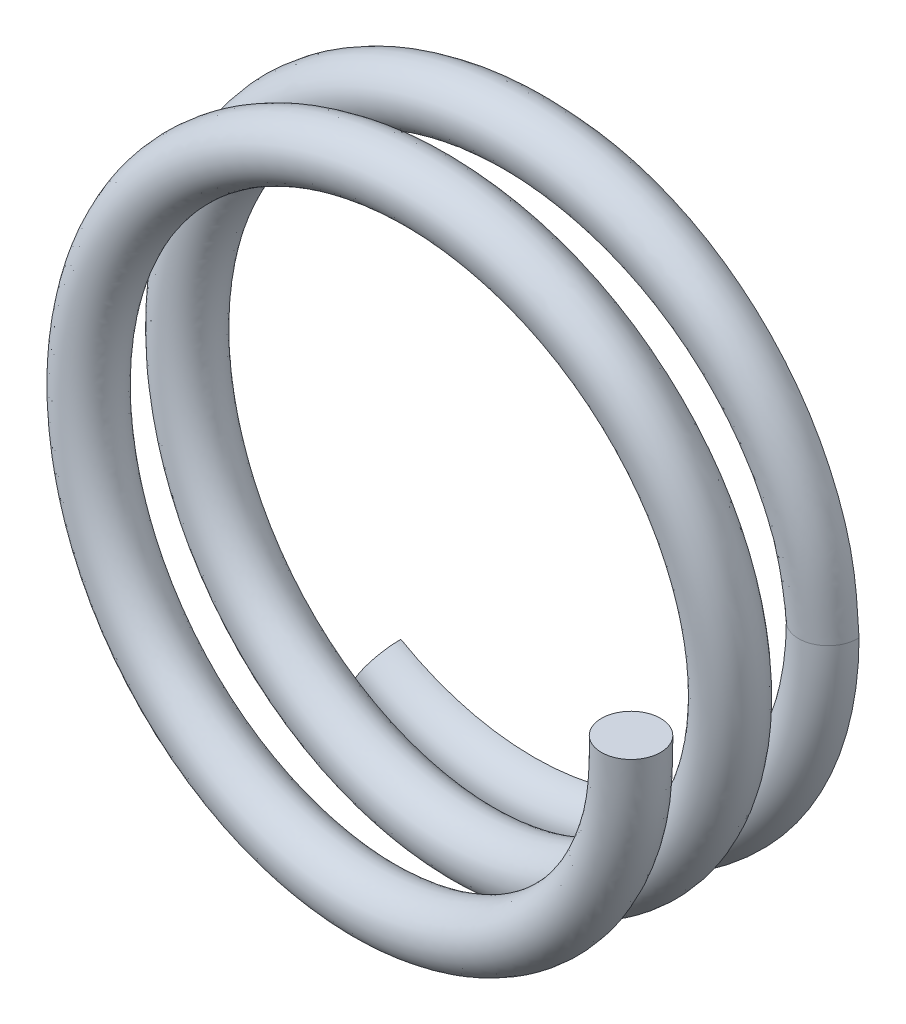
ISO-10303-21;
HEADER;
FILE_DESCRIPTION(('STEP AP214'),'2;1');
FILE_NAME('part.step','',(''),(''),'','','');
FILE_SCHEMA(('AUTOMOTIVE_DESIGN { 1 0 10303 214 1 1 1 1 }'));
ENDSEC;
DATA;
#1=APPLICATION_CONTEXT('core data for automotive mechanical design processes');
#2=APPLICATION_PROTOCOL_DEFINITION('international standard','automotive_design',2000,#1);
#3=PRODUCT_CONTEXT('',#1,'mechanical');
#4=PRODUCT('Part','Part','',(#3));
#5=PRODUCT_RELATED_PRODUCT_CATEGORY('part','',(#4));
#6=PRODUCT_DEFINITION_FORMATION('','',#4);
#7=PRODUCT_DEFINITION_CONTEXT('part definition',#1,'design');
#8=PRODUCT_DEFINITION('design','',#6,#7);
#9=PRODUCT_DEFINITION_SHAPE('','',#8);
#10=(LENGTH_UNIT() NAMED_UNIT(*) SI_UNIT(.MILLI.,.METRE.));
#11=(NAMED_UNIT(*) PLANE_ANGLE_UNIT() SI_UNIT($,.RADIAN.));
#12=(NAMED_UNIT(*) SI_UNIT($,.STERADIAN.) SOLID_ANGLE_UNIT());
#13=UNCERTAINTY_MEASURE_WITH_UNIT(LENGTH_MEASURE(1.E-05),#10,'distance_accuracy_value','');
#14=(GEOMETRIC_REPRESENTATION_CONTEXT(3) GLOBAL_UNCERTAINTY_ASSIGNED_CONTEXT((#13)) GLOBAL_UNIT_ASSIGNED_CONTEXT((#10,
#11,#12)) REPRESENTATION_CONTEXT('',''));
#15=CARTESIAN_POINT('',(0.,0.,0.));
#16=DIRECTION('',(0.,0.,1.));
#17=DIRECTION('',(1.,0.,0.));
#18=AXIS2_PLACEMENT_3D('',#15,#16,#17);
#19=CARTESIAN_POINT('',(15.,0.,1.5));
#20=CARTESIAN_POINT('',(14.9434686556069,0.980039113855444,1.55199637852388));
#21=CARTESIAN_POINT('',(14.8302225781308,2.94329660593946,1.65615781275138));
#22=CARTESIAN_POINT('',(13.9418455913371,5.77650274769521,1.81245356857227));
#23=CARTESIAN_POINT('',(12.5535226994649,8.38759891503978,1.96879275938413));
#24=CARTESIAN_POINT('',(10.4671696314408,10.9271623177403,2.14223062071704));
#25=CARTESIAN_POINT('',(7.58613571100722,13.1398555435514,2.33334011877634));
#26=CARTESIAN_POINT('',(3.92662071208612,14.6543917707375,2.54166504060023));
#27=CARTESIAN_POINT('',(4.11401899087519E-05,15.1715918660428,2.75000784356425));
#28=CARTESIAN_POINT('',(-3.92693257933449,14.6556022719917,2.95833111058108));
#29=CARTESIAN_POINT('',(-7.58586251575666,13.1389788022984,3.1666585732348));
#30=CARTESIAN_POINT('',(-10.7277085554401,10.7277374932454,3.37500627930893));
#31=CARTESIAN_POINT('',(-13.1395863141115,7.58619905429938,3.58333901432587));
#32=CARTESIAN_POINT('',(-14.6551693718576,3.92680798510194,3.79165669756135));
#33=CARTESIAN_POINT('',(-15.1712462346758,-3.12971002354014E-05,3.99999979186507));
#34=CARTESIAN_POINT('',(-14.6548300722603,-3.92669076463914,4.20834340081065));
#35=CARTESIAN_POINT('',(-13.1398206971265,-7.58627068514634,4.41666146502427));
#36=CARTESIAN_POINT('',(-10.7278130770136,-10.7278977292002,4.62499295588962));
#37=CARTESIAN_POINT('',(-7.58571450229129,-13.1387744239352,4.83334182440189));
#38=CARTESIAN_POINT('',(-3.92696085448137,-14.6554610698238,5.04166963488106));
#39=CARTESIAN_POINT('',(4.36291658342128E-05,-15.1719571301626,5.24998976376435));
#40=CARTESIAN_POINT('',(3.92661725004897,-14.6542791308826,5.45833563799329));
#41=CARTESIAN_POINT('',(7.5859316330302,-13.1393329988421,5.66667583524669));
#42=CARTESIAN_POINT('',(10.7285480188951,-10.7285399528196,5.87499262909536));
#43=CARTESIAN_POINT('',(13.1388208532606,-7.58563797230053,6.08332834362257));
#44=CARTESIAN_POINT('',(14.6545092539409,-3.92671133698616,6.29167635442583));
#45=CARTESIAN_POINT('',(15.1725636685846,-3.08605043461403E-05,6.50000018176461));
#46=CARTESIAN_POINT('',(14.6547973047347,3.92679649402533,6.70832353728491));
#47=CARTESIAN_POINT('',(13.1386860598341,7.58562008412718,6.91667133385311));
#48=CARTESIAN_POINT('',(10.7283643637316,10.7282883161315,7.12500762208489));
#49=CARTESIAN_POINT('',(7.58613817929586,13.1396144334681,7.33332434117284));
#50=CARTESIAN_POINT('',(3.92657585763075,14.6543562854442,7.54166400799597));
#51=CARTESIAN_POINT('',(5.35997314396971E-05,15.1716155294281,7.75001022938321));
#52=CARTESIAN_POINT('',(-3.92693805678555,14.6556080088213,7.95833071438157));
#53=CARTESIAN_POINT('',(-7.58585858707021,13.1389737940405,8.16665797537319));
#54=CARTESIAN_POINT('',(-10.7277098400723,10.7277381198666,8.37500677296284));
#55=CARTESIAN_POINT('',(-13.1395867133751,7.58619950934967,8.5833388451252));
#56=CARTESIAN_POINT('',(-14.6551692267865,3.92680794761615,8.79165668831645));
#57=CARTESIAN_POINT('',(-15.1712461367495,-3.14499375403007E-05,8.9999998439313));
#58=CARTESIAN_POINT('',(-14.654829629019,-3.92669054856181,9.20834339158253));
#59=CARTESIAN_POINT('',(-13.1398232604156,-7.58627176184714,9.41666129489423));
#60=CARTESIAN_POINT('',(-10.7278077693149,-10.7278945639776,9.62499345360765));
#61=CARTESIAN_POINT('',(-7.58571958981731,-13.1387763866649,9.83334122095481));
#62=CARTESIAN_POINT('',(-3.92696098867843,-14.655487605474,10.041669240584));
#63=CARTESIAN_POINT('',(2.9082075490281E-05,-15.171864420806,10.2499921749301));
#64=CARTESIAN_POINT('',(3.92668405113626,-14.6543878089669,10.4583345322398));
#65=CARTESIAN_POINT('',(7.58592254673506,-13.1395893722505,10.6666601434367));
#66=CARTESIAN_POINT('',(10.4672636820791,-10.9272676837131,10.8577695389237));
#67=CARTESIAN_POINT('',(12.553480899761,-8.38754549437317,11.0312069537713));
#68=CARTESIAN_POINT('',(13.9422248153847,-5.77671048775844,11.187546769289));
#69=CARTESIAN_POINT('',(14.8299103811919,-2.94320033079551,11.3438418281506));
#70=CARTESIAN_POINT('',(14.9432613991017,-0.980005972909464,11.4480035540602));
#71=CARTESIAN_POINT('',(14.9998450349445,4.25082742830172E-10,11.4999999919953));
#72=CARTESIAN_POINT('',(18.,0.,1.5));
#73=CARTESIAN_POINT('',(17.9323063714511,1.17617130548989,1.55193830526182));
#74=CARTESIAN_POINT('',(17.7966995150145,3.53232943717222,1.6559834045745));
#75=CARTESIAN_POINT('',(16.7304312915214,6.93069596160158,1.81304095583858));
#76=CARTESIAN_POINT('',(15.0648037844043,10.0648097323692,1.96888233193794));
#77=CARTESIAN_POINT('',(12.5582750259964,13.1148525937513,2.14252497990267));
#78=CARTESIAN_POINT('',(9.10608570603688,15.7659272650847,2.33316062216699));
#79=CARTESIAN_POINT('',(4.71216641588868,17.5858635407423,2.54183736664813));
#80=CARTESIAN_POINT('',(-0.00209417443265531,18.2059563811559,2.75042629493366));
#81=CARTESIAN_POINT('',(-4.71136257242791,17.5866699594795,2.958385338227));
#82=CARTESIAN_POINT('',(-9.10182717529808,15.7677965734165,3.16657352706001));
#83=CARTESIAN_POINT('',(-12.8743834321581,12.8727598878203,3.37533635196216));
#84=CARTESIAN_POINT('',(-15.7680538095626,9.10199791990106,3.58373251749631));
#85=CARTESIAN_POINT('',(-17.5855251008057,4.71436549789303,3.7914596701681));
#86=CARTESIAN_POINT('',(-18.2060659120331,-2.21536066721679E-05,4.00015466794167));
#87=CARTESIAN_POINT('',(-17.5851902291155,-4.71423300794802,4.20884973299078));
#88=CARTESIAN_POINT('',(-15.7682950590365,-9.10205608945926,4.41658110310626));
#89=CARTESIAN_POINT('',(-12.8745053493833,-12.8729042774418,4.62496853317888));
#90=CARTESIAN_POINT('',(-9.10167577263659,-15.7675961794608,4.83373398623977));
#91=CARTESIAN_POINT('',(-4.71143842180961,-17.5864986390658,5.04195919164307));
#92=CARTESIAN_POINT('',(-0.0021430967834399,-18.2063741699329,5.24981036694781));
#93=CARTESIAN_POINT('',(4.7124657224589,-17.5855720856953,5.45855207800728));
#94=CARTESIAN_POINT('',(9.1049848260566,-15.7659968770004,5.66717218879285));
#95=CARTESIAN_POINT('',(12.8726878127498,-12.8754697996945,5.8748441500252));
#96=CARTESIAN_POINT('',(15.7665939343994,-9.10371710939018,6.08336225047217));
#97=CARTESIAN_POINT('',(17.5861149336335,-4.71026018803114,6.29212393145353));
#98=CARTESIAN_POINT('',(18.2067610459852,-3.84891972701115E-05,6.50015514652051));
#99=CARTESIAN_POINT('',(17.5864072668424,4.71032890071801,6.70818589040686));
#100=CARTESIAN_POINT('',(15.7664681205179,9.10368379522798,6.91694735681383));
#101=CARTESIAN_POINT('',(12.8725152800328,12.875207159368,7.12546603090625));
#102=CARTESIAN_POINT('',(9.1052051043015,15.7662702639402,7.33313791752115));
#103=CARTESIAN_POINT('',(4.71244168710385,17.5856445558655,7.54175749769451));
#104=CARTESIAN_POINT('',(-0.00211652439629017,18.2060326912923,7.75049955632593));
#105=CARTESIAN_POINT('',(-4.71140083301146,17.5866495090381,7.95835108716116));
#106=CARTESIAN_POINT('',(-9.10180477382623,15.7678041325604,8.16657574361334));
#107=CARTESIAN_POINT('',(-12.8743897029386,12.872757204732,8.37534112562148));
#108=CARTESIAN_POINT('',(-15.7680534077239,9.10199831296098,8.58372913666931));
#109=CARTESIAN_POINT('',(-17.5855250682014,4.71436584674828,8.791460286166));
#110=CARTESIAN_POINT('',(-18.2060658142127,-2.25735037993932E-05,9.00015489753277));
#111=CARTESIAN_POINT('',(-17.5851896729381,-4.71423240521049,9.20885034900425));
#112=CARTESIAN_POINT('',(-15.7682984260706,-9.10205722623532,9.41657772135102));
#113=CARTESIAN_POINT('',(-12.8744950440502,-12.8729044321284,9.62497331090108));
#114=CARTESIAN_POINT('',(-9.10169935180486,-15.7675855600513,9.83373619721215));
#115=CARTESIAN_POINT('',(-4.71140576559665,-17.5865513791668,10.0419249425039));
#116=CARTESIAN_POINT('',(-0.00212275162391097,-18.2062287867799,10.2498836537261));
#117=CARTESIAN_POINT('',(4.71221213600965,-17.5858643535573,10.4584721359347));
#118=CARTESIAN_POINT('',(9.10585910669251,-15.7656689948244,10.6671495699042));
#119=CARTESIAN_POINT('',(12.5583574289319,-13.114968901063,10.8577851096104));
#120=CARTESIAN_POINT('',(15.0647522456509,-10.0647709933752,11.0314273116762));
#121=CARTESIAN_POINT('',(16.7308047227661,-6.9309177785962,11.1872693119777));
#122=CARTESIAN_POINT('',(17.7963837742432,-3.53225069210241,11.3443261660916));
#123=CARTESIAN_POINT('',(17.9320979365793,-1.17615475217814,11.4483715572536));
#124=CARTESIAN_POINT('',(17.99984501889,-1.64418778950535E-05,11.5003099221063));
#125=CARTESIAN_POINT('',(18.,0.,-1.5));
#126=CARTESIAN_POINT('',(17.9322539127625,1.17614724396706,-1.44806169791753));
#127=CARTESIAN_POINT('',(17.7965419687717,3.53225717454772,-1.34401660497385));
#128=CARTESIAN_POINT('',(16.7309520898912,6.93096946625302,-1.18695900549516));
#129=CARTESIAN_POINT('',(15.0648944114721,10.0648383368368,-1.03111766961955));
#130=CARTESIAN_POINT('',(12.5584754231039,13.1150736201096,-0.857475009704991));
#131=CARTESIAN_POINT('',(9.10594614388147,15.7657987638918,-0.666839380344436));
#132=CARTESIAN_POINT('',(4.71227811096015,17.5860086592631,-0.458162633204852));
#133=CARTESIAN_POINT('',(-0.00210690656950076,18.2063865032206,-0.249573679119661));
#134=CARTESIAN_POINT('',(-4.71143793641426,17.5867047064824,-0.0416146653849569));
#135=CARTESIAN_POINT('',(-9.10175901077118,15.7677312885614,0.166573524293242));
#136=CARTESIAN_POINT('',(-12.8745903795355,12.873031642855,0.375336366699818));
#137=CARTESIAN_POINT('',(-15.7684298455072,9.10214392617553,0.583732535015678));
#138=CARTESIAN_POINT('',(-17.5853365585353,4.71428665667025,0.791459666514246));
#139=CARTESIAN_POINT('',(-18.2062225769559,4.75475799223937E-05,1.0001546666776));
#140=CARTESIAN_POINT('',(-17.5856809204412,-4.71439295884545,1.20884976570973));
#141=CARTESIAN_POINT('',(-15.7681935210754,-9.10206822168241,1.41658109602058));
#142=CARTESIAN_POINT('',(-12.874516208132,-12.8728515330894,1.62496852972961));
#143=CARTESIAN_POINT('',(-9.1019016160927,-15.7679300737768,1.83373400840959));
#144=CARTESIAN_POINT('',(-4.71144975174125,-17.5867989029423,2.04195919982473));
#145=CARTESIAN_POINT('',(-0.00213308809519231,-18.206188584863,2.24981036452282));
#146=CARTESIAN_POINT('',(4.71245845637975,-17.5858025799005,2.45855208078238));
#147=CARTESIAN_POINT('',(9.10527327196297,-15.7664127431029,2.66717221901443));
#148=CARTESIAN_POINT('',(12.8726180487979,-12.8753251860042,2.87484414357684));
#149=CARTESIAN_POINT('',(15.7665915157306,-9.10378273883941,3.08336224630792));
#150=CARTESIAN_POINT('',(17.5865546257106,-4.71038774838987,3.29212395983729));
#151=CARTESIAN_POINT('',(18.2069177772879,3.01427640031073E-05,3.50015514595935));
#152=CARTESIAN_POINT('',(17.5862704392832,4.71028228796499,3.70818588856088));
#153=CARTESIAN_POINT('',(15.7667420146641,9.10377499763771,3.9169473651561));
#154=CARTESIAN_POINT('',(12.8728065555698,12.875573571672,4.12546605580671));
#155=CARTESIAN_POINT('',(9.10507359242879,15.7661257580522,4.33313791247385));
#156=CARTESIAN_POINT('',(4.71253014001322,17.585716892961,4.54175749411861));
#157=CARTESIAN_POINT('',(-0.00212675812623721,18.2065317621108,4.75049958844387));
#158=CARTESIAN_POINT('',(-4.71147054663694,17.586652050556,4.9583510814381));
#159=CARTESIAN_POINT('',(-9.10173554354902,15.7677418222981,5.16657574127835));
#160=CARTESIAN_POINT('',(-12.8746006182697,12.8730315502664,5.37534114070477));
#161=CARTESIAN_POINT('',(-15.7684264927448,9.10214277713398,5.58372915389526));
#162=CARTESIAN_POINT('',(-17.5853371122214,4.71428725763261,5.7914602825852));
#163=CARTESIAN_POINT('',(-18.2062226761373,4.71276689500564E-05,6.00015489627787));
#164=CARTESIAN_POINT('',(-17.5856809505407,-4.71439260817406,6.20885038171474));
#165=CARTESIAN_POINT('',(-15.7681939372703,-9.10206781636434,6.41657771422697));
#166=CARTESIAN_POINT('',(-12.8745098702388,-12.8728542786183,6.62497330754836));
#167=CARTESIAN_POINT('',(-9.10192413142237,-15.7679224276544,6.83373621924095));
#168=CARTESIAN_POINT('',(-4.71141144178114,-17.5868194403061,7.04192494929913));
#169=CARTESIAN_POINT('',(-0.00211024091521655,-18.2061121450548,7.249883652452));
#170=CARTESIAN_POINT('',(4.71218159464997,-17.5860220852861,7.45847213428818));
#171=CARTESIAN_POINT('',(9.10615569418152,-15.7660687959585,7.66714960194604));
#172=CARTESIAN_POINT('',(12.5583730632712,-13.1149738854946,7.85778510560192));
#173=CARTESIAN_POINT('',(15.0649210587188,-10.0649156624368,8.0314273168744));
#174=CARTESIAN_POINT('',(16.7305720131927,-6.93076351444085,8.18726930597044));
#175=CARTESIAN_POINT('',(17.7968477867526,-3.53238380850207,8.34432619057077));
#176=CARTESIAN_POINT('',(17.9324591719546,-1.17619907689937,8.44837157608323));
#177=CARTESIAN_POINT('',(18.000154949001,-1.64427272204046E-05,8.50030993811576));
#178=CARTESIAN_POINT('',(15.,0.,-1.5));
#179=CARTESIAN_POINT('',(14.9434161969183,0.980015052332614,-1.44800362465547));
#180=CARTESIAN_POINT('',(14.830065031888,2.94322434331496,-1.34384219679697));
#181=CARTESIAN_POINT('',(13.9423663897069,5.77677625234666,-1.18754639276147));
#182=CARTESIAN_POINT('',(12.5536133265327,8.38762751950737,-1.03120724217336));
#183=CARTESIAN_POINT('',(10.4673700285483,10.9273833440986,-0.857769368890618));
#184=CARTESIAN_POINT('',(7.58599614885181,13.1397270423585,-0.666659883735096));
#185=CARTESIAN_POINT('',(3.92673240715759,14.6545368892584,-0.458334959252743));
#186=CARTESIAN_POINT('',(2.84080530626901E-05,15.1720219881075,-0.249992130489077));
#187=CARTESIAN_POINT('',(-3.92700794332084,14.6556370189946,-0.0416688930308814));
#188=CARTESIAN_POINT('',(-7.58579435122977,13.1389135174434,0.166658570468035));
#189=CARTESIAN_POINT('',(-10.7279155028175,10.7280092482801,0.375006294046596));
#190=CARTESIAN_POINT('',(-13.1399623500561,7.58634506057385,0.58333903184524));
#191=CARTESIAN_POINT('',(-14.6549808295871,3.92672914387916,0.791656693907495));
#192=CARTESIAN_POINT('',(-15.1714028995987,3.8404086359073E-05,0.999999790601));
#193=CARTESIAN_POINT('',(-14.655320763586,-3.92685071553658,1.2083434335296));
#194=CARTESIAN_POINT('',(-13.1397191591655,-7.58628281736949,1.41666145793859));
#195=CARTESIAN_POINT('',(-10.7278239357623,-10.7278449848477,1.62499295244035));
#196=CARTESIAN_POINT('',(-7.58594034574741,-13.1391083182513,1.83334184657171));
#197=CARTESIAN_POINT('',(-3.926972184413,-14.6557613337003,2.04166964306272));
#198=CARTESIAN_POINT('',(5.36378540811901E-05,-15.1717715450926,2.24998976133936));
#199=CARTESIAN_POINT('',(3.92660998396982,-14.6545096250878,2.45833564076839));
#200=CARTESIAN_POINT('',(7.58622007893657,-13.1397488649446,2.66667586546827));
#201=CARTESIAN_POINT('',(10.7284782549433,-10.7283953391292,2.87499262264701));
#202=CARTESIAN_POINT('',(13.1388184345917,-7.58570360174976,3.08332833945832));
#203=CARTESIAN_POINT('',(14.654948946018,-3.9268388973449,3.2916763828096));
#204=CARTESIAN_POINT('',(15.1727203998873,3.77714569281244E-05,3.50000018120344));
#205=CARTESIAN_POINT('',(14.6546604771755,3.92674988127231,3.70832353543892));
#206=CARTESIAN_POINT('',(13.1389599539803,7.58571128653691,3.91667134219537));
#207=CARTESIAN_POINT('',(10.7286556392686,10.7286547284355,4.12500764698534));
#208=CARTESIAN_POINT('',(7.58600666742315,13.13946992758,4.33332433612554));
#209=CARTESIAN_POINT('',(3.92666431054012,14.6544286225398,4.54166400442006));
#210=CARTESIAN_POINT('',(4.33660014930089E-05,15.1721146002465,4.75001026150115));
#211=CARTESIAN_POINT('',(-3.92700777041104,14.6556105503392,4.95833070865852));
#212=CARTESIAN_POINT('',(-7.585789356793,13.1389114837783,5.1666579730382));
#213=CARTESIAN_POINT('',(-10.7279207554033,10.728012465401,5.37500678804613));
#214=CARTESIAN_POINT('',(-13.1399597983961,7.58634397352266,5.58333886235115));
#215=CARTESIAN_POINT('',(-14.6549812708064,3.92672935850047,5.79165668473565));
#216=CARTESIAN_POINT('',(-15.1714029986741,3.82512352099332E-05,5.9999998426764));
#217=CARTESIAN_POINT('',(-14.6553209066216,-3.92685075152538,6.20834342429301));
#218=CARTESIAN_POINT('',(-13.1397187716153,-7.58628235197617,6.41666128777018));
#219=CARTESIAN_POINT('',(-10.7278225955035,-10.7278444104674,6.62499345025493));
#220=CARTESIAN_POINT('',(-7.58594436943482,-13.139113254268,6.83334124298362));
#221=CARTESIAN_POINT('',(-3.92696666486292,-14.6557556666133,7.04166924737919));
#222=CARTESIAN_POINT('',(4.15927841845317E-05,-15.171747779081,7.24999217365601));
#223=CARTESIAN_POINT('',(3.92665350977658,-14.6545455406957,7.45833453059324));
#224=CARTESIAN_POINT('',(7.58621913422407,-13.1399891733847,7.6666601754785));
#225=CARTESIAN_POINT('',(10.4672793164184,-10.9272726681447,7.85776953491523));
#226=CARTESIAN_POINT('',(12.5536497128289,-8.38769016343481,8.03120695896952));
#227=CARTESIAN_POINT('',(13.9419921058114,-5.77655622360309,8.1875467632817));
#228=CARTESIAN_POINT('',(14.8303743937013,-2.94333344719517,8.34384185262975));
#229=CARTESIAN_POINT('',(14.943622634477,-0.980050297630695,8.44800357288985));
#230=CARTESIAN_POINT('',(15.0001549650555,-4.24242608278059E-10,8.50000000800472));
#231=CARTESIAN_POINT('',(12.,0.,-1.5));
#232=CARTESIAN_POINT('',(11.9545784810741,0.783882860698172,-1.44794555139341));
#233=CARTESIAN_POINT('',(11.8635880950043,2.35419151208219,-1.34366778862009));
#234=CARTESIAN_POINT('',(11.1537806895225,4.6225830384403,-1.18813378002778));
#235=CARTESIAN_POINT('',(10.0423322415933,6.71041670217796,-1.03129681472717));
#236=CARTESIAN_POINT('',(8.37626463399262,8.73969306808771,-0.858063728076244));
#237=CARTESIAN_POINT('',(6.06604615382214,10.5136553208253,-0.666480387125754));
#238=CARTESIAN_POINT('',(3.14118670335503,11.7230651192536,-0.458507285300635));
#239=CARTESIAN_POINT('',(0.00216372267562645,12.1376574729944,-0.250410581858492));
#240=CARTESIAN_POINT('',(-3.14257795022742,11.7245693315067,-0.041723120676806));
#241=CARTESIAN_POINT('',(-6.06982969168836,10.5100957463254,0.166743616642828));
#242=CARTESIAN_POINT('',(-8.5812406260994,8.58298685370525,0.374676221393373));
#243=CARTESIAN_POINT('',(-10.5114948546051,6.07054619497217,0.582945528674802));
#244=CARTESIAN_POINT('',(-11.724625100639,3.13917163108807,0.791853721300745));
#245=CARTESIAN_POINT('',(-12.1365832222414,2.92605927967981E-05,0.999844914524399));
#246=CARTESIAN_POINT('',(-11.7249606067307,-3.13930847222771,1.20783710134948));
#247=CARTESIAN_POINT('',(-10.5112447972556,-6.07049741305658,1.4167418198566));
#248=CARTESIAN_POINT('',(-8.58113166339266,-8.58283843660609,1.62501737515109));
#249=CARTESIAN_POINT('',(-6.06997907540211,-10.5102865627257,1.83294968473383));
#250=CARTESIAN_POINT('',(-3.14249461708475,-11.7247237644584,2.04138008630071));
#251=CARTESIAN_POINT('',(0.00224036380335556,-12.1373545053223,2.25016915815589));
#252=CARTESIAN_POINT('',(3.14076151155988,-11.7232166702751,2.45811920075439));
#253=CARTESIAN_POINT('',(6.06716688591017,-10.5130849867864,2.6661795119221));
#254=CARTESIAN_POINT('',(8.58433846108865,-8.58146549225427,2.87514110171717));
#255=CARTESIAN_POINT('',(10.5110453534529,-6.06762446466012,3.08329443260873));
#256=CARTESIAN_POINT('',(11.7233432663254,-3.14329004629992,3.2912288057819));
#257=CARTESIAN_POINT('',(12.1385230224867,4.54001498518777E-05,3.49984521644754));
#258=CARTESIAN_POINT('',(11.7230505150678,3.14321747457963,3.70846118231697));
#259=CARTESIAN_POINT('',(10.5111778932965,6.06764757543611,3.91639531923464));
#260=CARTESIAN_POINT('',(8.58450472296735,8.58173588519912,4.12454923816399));
#261=CARTESIAN_POINT('',(6.06693974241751,10.5128140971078,4.33351075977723));
#262=CARTESIAN_POINT('',(3.14079848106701,11.7231403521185,4.54157051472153));
#263=CARTESIAN_POINT('',(0.00221349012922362,12.1376974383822,4.74952093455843));
#264=CARTESIAN_POINT('',(-3.14254499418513,11.7245690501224,4.95831033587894));
#265=CARTESIAN_POINT('',(-6.06984317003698,10.5100811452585,5.16674020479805));
#266=CARTESIAN_POINT('',(-8.58124089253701,8.58299338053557,5.37467243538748));
#267=CARTESIAN_POINT('',(-10.5114931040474,6.07054516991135,5.58294857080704));
#268=CARTESIAN_POINT('',(-11.7246254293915,3.13917145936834,5.79185308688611));
#269=CARTESIAN_POINT('',(-12.136583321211,2.93748014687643E-05,5.99984478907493));
#270=CARTESIAN_POINT('',(-11.7249608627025,-3.1393088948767,6.20783646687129));
#271=CARTESIAN_POINT('',(-10.5112436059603,-6.07049688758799,6.41674486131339));
#272=CARTESIAN_POINT('',(-8.58113532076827,-8.58283454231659,6.6250135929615));
#273=CARTESIAN_POINT('',(-6.06996460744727,-10.5103040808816,6.83294626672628));
#274=CARTESIAN_POINT('',(-3.14252188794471,-11.7246918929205,7.04141354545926));
#275=CARTESIAN_POINT('',(0.0021934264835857,-12.1373834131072,7.25010069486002));
#276=CARTESIAN_POINT('',(3.14112542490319,-11.7230689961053,7.45819692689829));
#277=CARTESIAN_POINT('',(6.06628257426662,-10.5139095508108,7.66617074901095));
#278=CARTESIAN_POINT('',(8.37618556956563,-8.7395714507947,7.85775396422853));
#279=CARTESIAN_POINT('',(10.042378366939,-6.71046466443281,8.03098660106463));
#280=CARTESIAN_POINT('',(11.15341219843,-4.62234893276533,8.18782422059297));
#281=CARTESIAN_POINT('',(11.8639010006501,-2.35428308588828,8.34335751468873));
#282=CARTESIAN_POINT('',(11.9547860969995,-0.783901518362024,8.44763556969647));
#283=CARTESIAN_POINT('',(12.00015498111,1.6441878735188E-05,8.49969007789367));
#284=CARTESIAN_POINT('',(12.,0.,1.5));
#285=CARTESIAN_POINT('',(11.9546309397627,0.783906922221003,1.55205445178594));
#286=CARTESIAN_POINT('',(11.8637456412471,2.35426377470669,1.65633222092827));
#287=CARTESIAN_POINT('',(11.1532598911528,4.62230953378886,1.81186618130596));
#288=CARTESIAN_POINT('',(10.0422416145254,6.71038809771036,1.96870318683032));
#289=CARTESIAN_POINT('',(8.37606423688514,8.73947204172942,2.14193626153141));
#290=CARTESIAN_POINT('',(6.06618571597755,10.5137838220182,2.33351961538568));
#291=CARTESIAN_POINT('',(3.14107500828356,11.7229200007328,2.54149271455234));
#292=CARTESIAN_POINT('',(0.00217645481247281,12.1372273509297,2.74958939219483));
#293=CARTESIAN_POINT('',(-3.14250258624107,11.7245345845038,2.95827688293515));
#294=CARTESIAN_POINT('',(-6.06989785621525,10.5101610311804,3.16674361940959));
#295=CARTESIAN_POINT('',(-8.581033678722,8.58271509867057,3.37467620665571));
#296=CARTESIAN_POINT('',(-10.5111188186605,6.07040018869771,3.58294551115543));
#297=CARTESIAN_POINT('',(-11.7248136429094,3.13925047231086,3.7918537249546));
#298=CARTESIAN_POINT('',(-12.1364265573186,-4.04405937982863E-05,3.99984491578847));
#299=CARTESIAN_POINT('',(-11.7244699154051,-3.13914852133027,4.20783706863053));
#300=CARTESIAN_POINT('',(-10.5113463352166,-6.07048528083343,4.41674182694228));
#301=CARTESIAN_POINT('',(-8.58112080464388,-8.58289118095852,4.62501737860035));
#302=CARTESIAN_POINT('',(-6.069753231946,-10.5099526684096,4.83294966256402));
#303=CARTESIAN_POINT('',(-3.14248328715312,-11.7244235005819,5.04138007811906));
#304=CARTESIAN_POINT('',(0.00223035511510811,-12.1375400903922,5.25016916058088));
#305=CARTESIAN_POINT('',(3.14076877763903,-11.7229861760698,5.4581191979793));
#306=CARTESIAN_POINT('',(6.0668784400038,-10.5126691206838,5.66617948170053));
#307=CARTESIAN_POINT('',(8.58440822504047,-8.5816101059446,5.87514110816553));
#308=CARTESIAN_POINT('',(10.5110477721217,-6.06755883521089,6.08329443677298));
#309=CARTESIAN_POINT('',(11.7229035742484,-3.14316248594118,6.29122877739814));
#310=CARTESIAN_POINT('',(12.138366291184,-2.32318114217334E-05,6.4998452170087));
#311=CARTESIAN_POINT('',(11.723187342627,3.14326408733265,6.70846118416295));
#312=CARTESIAN_POINT('',(10.5109039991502,6.06755637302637,6.91639531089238));
#313=CARTESIAN_POINT('',(8.58421344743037,8.58136947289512,7.12454921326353));
#314=CARTESIAN_POINT('',(6.06707125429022,10.5129586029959,7.33351076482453));
#315=CARTESIAN_POINT('',(3.14071002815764,11.723068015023,7.54157051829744));
#316=CARTESIAN_POINT('',(0.00222372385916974,12.1371983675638,7.74952090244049));
#317=CARTESIAN_POINT('',(-3.14247528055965,11.7245665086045,7.95831034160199));
#318=CARTESIAN_POINT('',(-6.0699124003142,10.5101434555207,8.16674020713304));
#319=CARTESIAN_POINT('',(-8.58102997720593,8.58271903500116,8.3746724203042));
#320=CARTESIAN_POINT('',(-10.5111200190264,6.07040070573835,8.58294855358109));
#321=CARTESIAN_POINT('',(-11.7248133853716,3.13925004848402,8.79185309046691));
#322=CARTESIAN_POINT('',(-12.1364264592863,-4.0326371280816E-05,8.99984479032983));
#323=CARTESIAN_POINT('',(-11.7244695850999,-3.13914869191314,9.2078364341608));
#324=CARTESIAN_POINT('',(-10.5113480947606,-6.07048629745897,9.41674486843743));
#325=CARTESIAN_POINT('',(-8.58112049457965,-8.58288469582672,9.62501359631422));
#326=CARTESIAN_POINT('',(-6.06973982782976,-10.5099672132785,9.83294624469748));
#327=CARTESIAN_POINT('',(-3.14251621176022,-11.7244238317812,10.0414135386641));
#328=CARTESIAN_POINT('',(0.00218091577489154,-12.1375000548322,10.2501006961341));
#329=CARTESIAN_POINT('',(3.14115596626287,-11.7229112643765,10.4581969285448));
#330=CARTESIAN_POINT('',(6.06598598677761,-10.5135097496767,10.6661707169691));
#331=CARTESIAN_POINT('',(8.37616993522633,-8.7395664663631,10.857753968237));
#332=CARTESIAN_POINT('',(10.0422095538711,-6.71031999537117,11.0309865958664));
#333=CARTESIAN_POINT('',(11.1536449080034,-4.62250319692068,11.1878242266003));
#334=CARTESIAN_POINT('',(11.8634369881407,-2.35414996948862,11.3433574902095));
#335=CARTESIAN_POINT('',(11.9544248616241,-0.783857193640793,11.4476355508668));
#336=CARTESIAN_POINT('',(11.999845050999,1.64427280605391E-05,11.4996900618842));
#337=CARTESIAN_POINT('',(15.,0.,1.5));
#338=CARTESIAN_POINT('',(14.9434686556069,0.980039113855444,1.55199637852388));
#339=CARTESIAN_POINT('',(14.8302225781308,2.94329660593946,1.65615781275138));
#340=CARTESIAN_POINT('',(13.9418455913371,5.77650274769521,1.81245356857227));
#341=CARTESIAN_POINT('',(12.5535226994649,8.38759891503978,1.96879275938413));
#342=CARTESIAN_POINT('',(10.4671696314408,10.9271623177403,2.14223062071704));
#343=CARTESIAN_POINT('',(7.58613571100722,13.1398555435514,2.33334011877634));
#344=CARTESIAN_POINT('',(3.92662071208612,14.6543917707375,2.54166504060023));
#345=CARTESIAN_POINT('',(4.11401899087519E-05,15.1715918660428,2.75000784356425));
#346=CARTESIAN_POINT('',(-3.92693257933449,14.6556022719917,2.95833111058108));
#347=CARTESIAN_POINT('',(-7.58586251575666,13.1389788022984,3.1666585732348));
#348=CARTESIAN_POINT('',(-10.7277085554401,10.7277374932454,3.37500627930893));
#349=CARTESIAN_POINT('',(-13.1395863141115,7.58619905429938,3.58333901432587));
#350=CARTESIAN_POINT('',(-14.6551693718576,3.92680798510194,3.79165669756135));
#351=CARTESIAN_POINT('',(-15.1712462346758,-3.12971002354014E-05,3.99999979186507));
#352=CARTESIAN_POINT('',(-14.6548300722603,-3.92669076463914,4.20834340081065));
#353=CARTESIAN_POINT('',(-13.1398206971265,-7.58627068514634,4.41666146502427));
#354=CARTESIAN_POINT('',(-10.7278130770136,-10.7278977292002,4.62499295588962));
#355=CARTESIAN_POINT('',(-7.58571450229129,-13.1387744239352,4.83334182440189));
#356=CARTESIAN_POINT('',(-3.92696085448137,-14.6554610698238,5.04166963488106));
#357=CARTESIAN_POINT('',(4.36291658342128E-05,-15.1719571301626,5.24998976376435));
#358=CARTESIAN_POINT('',(3.92661725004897,-14.6542791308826,5.45833563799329));
#359=CARTESIAN_POINT('',(7.5859316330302,-13.1393329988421,5.66667583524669));
#360=CARTESIAN_POINT('',(10.7285480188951,-10.7285399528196,5.87499262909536));
#361=CARTESIAN_POINT('',(13.1388208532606,-7.58563797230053,6.08332834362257));
#362=CARTESIAN_POINT('',(14.6545092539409,-3.92671133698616,6.29167635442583));
#363=CARTESIAN_POINT('',(15.1725636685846,-3.08605043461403E-05,6.50000018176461));
#364=CARTESIAN_POINT('',(14.6547973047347,3.92679649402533,6.70832353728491));
#365=CARTESIAN_POINT('',(13.1386860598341,7.58562008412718,6.91667133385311));
#366=CARTESIAN_POINT('',(10.7283643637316,10.7282883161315,7.12500762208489));
#367=CARTESIAN_POINT('',(7.58613817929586,13.1396144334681,7.33332434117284));
#368=CARTESIAN_POINT('',(3.92657585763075,14.6543562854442,7.54166400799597));
#369=CARTESIAN_POINT('',(5.35997314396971E-05,15.1716155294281,7.75001022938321));
#370=CARTESIAN_POINT('',(-3.92693805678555,14.6556080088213,7.95833071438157));
#371=CARTESIAN_POINT('',(-7.58585858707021,13.1389737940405,8.16665797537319));
#372=CARTESIAN_POINT('',(-10.7277098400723,10.7277381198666,8.37500677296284));
#373=CARTESIAN_POINT('',(-13.1395867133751,7.58619950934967,8.5833388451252));
#374=CARTESIAN_POINT('',(-14.6551692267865,3.92680794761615,8.79165668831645));
#375=CARTESIAN_POINT('',(-15.1712461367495,-3.14499375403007E-05,8.9999998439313));
#376=CARTESIAN_POINT('',(-14.654829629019,-3.92669054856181,9.20834339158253));
#377=CARTESIAN_POINT('',(-13.1398232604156,-7.58627176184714,9.41666129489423));
#378=CARTESIAN_POINT('',(-10.7278077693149,-10.7278945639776,9.62499345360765));
#379=CARTESIAN_POINT('',(-7.58571958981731,-13.1387763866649,9.83334122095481));
#380=CARTESIAN_POINT('',(-3.92696098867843,-14.655487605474,10.041669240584));
#381=CARTESIAN_POINT('',(2.9082075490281E-05,-15.171864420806,10.2499921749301));
#382=CARTESIAN_POINT('',(3.92668405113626,-14.6543878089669,10.4583345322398));
#383=CARTESIAN_POINT('',(7.58592254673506,-13.1395893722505,10.6666601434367));
#384=CARTESIAN_POINT('',(10.4672636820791,-10.9272676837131,10.8577695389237));
#385=CARTESIAN_POINT('',(12.553480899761,-8.38754549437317,11.0312069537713));
#386=CARTESIAN_POINT('',(13.9422248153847,-5.77671048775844,11.187546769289));
#387=CARTESIAN_POINT('',(14.8299103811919,-2.94320033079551,11.3438418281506));
#388=CARTESIAN_POINT('',(14.9432613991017,-0.980005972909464,11.4480035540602));
#389=CARTESIAN_POINT('',(14.9998450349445,4.25082742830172E-10,11.4999999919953));
#390=(BOUNDED_SURFACE() B_SPLINE_SURFACE(3,3,((#19,#20,#21,#22,#23,#24,#25,#26,#27,#28,#29,#30,
#31,#32,#33,#34,#35,#36,#37,#38,#39,#40,#41,#42,#43,#44,#45,#46,#47,#48,#49,#50,#51,#52,#53,#54,
#55,#56,#57,#58,#59,#60,#61,#62,#63,#64,#65,#66,#67,#68,#69,#70,#71),(#72,#73,#74,#75,#76,#77,
#78,#79,#80,#81,#82,#83,#84,#85,#86,#87,#88,#89,#90,#91,#92,#93,#94,#95,#96,#97,#98,#99,#100,
#101,#102,#103,#104,#105,#106,#107,#108,#109,#110,#111,#112,#113,#114,#115,#116,#117,#118,#119,
#120,#121,#122,#123,#124),(#125,#126,#127,#128,#129,#130,#131,#132,#133,#134,#135,#136,#137,
#138,#139,#140,#141,#142,#143,#144,#145,#146,#147,#148,#149,#150,#151,#152,#153,#154,#155,#156,
#157,#158,#159,#160,#161,#162,#163,#164,#165,#166,#167,#168,#169,#170,#171,#172,#173,#174,#175,
#176,#177),(#178,#179,#180,#181,#182,#183,#184,#185,#186,#187,#188,#189,#190,#191,#192,#193,
#194,#195,#196,#197,#198,#199,#200,#201,#202,#203,#204,#205,#206,#207,#208,#209,#210,#211,#212,
#213,#214,#215,#216,#217,#218,#219,#220,#221,#222,#223,#224,#225,#226,#227,#228,#229,#230),
(#231,#232,#233,#234,#235,#236,#237,#238,#239,#240,#241,#242,#243,#244,#245,#246,#247,#248,#249,
#250,#251,#252,#253,#254,#255,#256,#257,#258,#259,#260,#261,#262,#263,#264,#265,#266,#267,#268,
#269,#270,#271,#272,#273,#274,#275,#276,#277,#278,#279,#280,#281,#282,#283),(#284,#285,#286,
#287,#288,#289,#290,#291,#292,#293,#294,#295,#296,#297,#298,#299,#300,#301,#302,#303,#304,#305,
#306,#307,#308,#309,#310,#311,#312,#313,#314,#315,#316,#317,#318,#319,#320,#321,#322,#323,#324,
#325,#326,#327,#328,#329,#330,#331,#332,#333,#334,#335,#336),(#337,#338,#339,#340,#341,#342,
#343,#344,#345,#346,#347,#348,#349,#350,#351,#352,#353,#354,#355,#356,#357,#358,#359,#360,#361,
#362,#363,#364,#365,#366,#367,#368,#369,#370,#371,#372,#373,#374,#375,#376,#377,#378,#379,#380,
#381,#382,#383,#384,#385,#386,#387,#388,#389)),.UNSPECIFIED.,.T.,.F.,
.F.) B_SPLINE_SURFACE_WITH_KNOTS((4,3,4),(4,1,1,1,1,1,1,1,1,1,1,1,1,1,1,1,1,1,1,1,1,1,1,1,1,1,1,
1,1,1,1,1,1,1,1,1,1,1,1,1,1,1,1,1,1,1,1,1,1,1,4),(0.,0.5,1.),(0.,0.0156173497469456,
0.0312853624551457,0.046931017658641,0.0625669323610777,0.0833983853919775,0.104228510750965,
0.125057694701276,0.145888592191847,0.166719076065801,0.187548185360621,0.208378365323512,
0.229209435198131,0.250038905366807,0.270868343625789,0.29169940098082,0.312529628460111,
0.333358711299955,0.354189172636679,0.375020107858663,0.395849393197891,0.416679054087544,
0.437510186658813,0.458340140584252,0.479169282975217,0.499999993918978,0.520830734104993,
0.541659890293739,0.562489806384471,0.583320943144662,0.604150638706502,0.624979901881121,
0.64581081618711,0.666641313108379,0.687470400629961,0.70830058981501,0.729131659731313,
0.749961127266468,0.770790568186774,0.791621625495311,0.812451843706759,0.833280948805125,
0.854111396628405,0.874942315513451,0.895771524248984,0.916601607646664,0.937433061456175,
0.953068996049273,0.968714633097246,0.984382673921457,1.),
.UNSPECIFIED.) GEOMETRIC_REPRESENTATION_ITEM() RATIONAL_B_SPLINE_SURFACE(((1.,1.,1.,1.,1.,1.,1.,
1.,1.,1.,1.,1.,1.,1.,1.,1.,1.,1.,1.,1.,1.,1.,1.,1.,1.,1.,1.,1.,1.,1.,1.,1.,1.,1.,1.,1.,1.,1.,1.,
1.,1.,1.,1.,1.,1.,1.,1.,1.,1.,1.,1.,1.,1.),(0.333333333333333,0.333333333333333,
0.333333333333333,0.333333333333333,0.333333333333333,0.333333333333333,0.333333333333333,
0.333333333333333,0.333333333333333,0.333333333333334,0.333333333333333,0.333333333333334,
0.333333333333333,0.333333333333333,0.333333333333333,0.333333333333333,0.333333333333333,
0.333333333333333,0.333333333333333,0.333333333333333,0.333333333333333,0.333333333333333,
0.333333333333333,0.333333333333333,0.333333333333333,0.333333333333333,0.333333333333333,
0.333333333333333,0.333333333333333,0.333333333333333,0.333333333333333,0.333333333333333,
0.333333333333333,0.333333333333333,0.333333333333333,0.333333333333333,0.333333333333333,
0.333333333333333,0.333333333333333,0.333333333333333,0.333333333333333,0.333333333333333,
0.333333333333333,0.333333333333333,0.333333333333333,0.333333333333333,0.333333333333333,
0.333333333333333,0.333333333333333,0.333333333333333,0.333333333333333,0.333333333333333,
0.333333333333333),(0.333333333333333,0.333333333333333,0.333333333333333,0.333333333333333,
0.333333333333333,0.333333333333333,0.333333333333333,0.333333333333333,0.333333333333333,
0.333333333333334,0.333333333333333,0.333333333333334,0.333333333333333,0.333333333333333,
0.333333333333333,0.333333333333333,0.333333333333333,0.333333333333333,0.333333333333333,
0.333333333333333,0.333333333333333,0.333333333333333,0.333333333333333,0.333333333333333,
0.333333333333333,0.333333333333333,0.333333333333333,0.333333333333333,0.333333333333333,
0.333333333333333,0.333333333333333,0.333333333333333,0.333333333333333,0.333333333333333,
0.333333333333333,0.333333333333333,0.333333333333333,0.333333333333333,0.333333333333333,
0.333333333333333,0.333333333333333,0.333333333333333,0.333333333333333,0.333333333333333,
0.333333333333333,0.333333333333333,0.333333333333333,0.333333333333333,0.333333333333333,
0.333333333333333,0.333333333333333,0.333333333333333,0.333333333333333),(1.,1.,1.,1.,1.,1.,1.,
1.,1.,1.,1.,1.,1.,1.,1.,1.,1.,1.,1.,1.,1.,1.,1.,1.,1.,1.,1.,1.,1.,1.,1.,1.,1.,1.,1.,1.,1.,1.,1.,
1.,1.,1.,1.,1.,1.,1.,1.,1.,1.,1.,1.,1.,1.),(0.333333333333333,0.333333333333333,
0.333333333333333,0.333333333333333,0.333333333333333,0.333333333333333,0.333333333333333,
0.333333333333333,0.333333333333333,0.333333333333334,0.333333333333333,0.333333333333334,
0.333333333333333,0.333333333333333,0.333333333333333,0.333333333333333,0.333333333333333,
0.333333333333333,0.333333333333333,0.333333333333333,0.333333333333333,0.333333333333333,
0.333333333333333,0.333333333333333,0.333333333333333,0.333333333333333,0.333333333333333,
0.333333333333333,0.333333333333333,0.333333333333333,0.333333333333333,0.333333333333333,
0.333333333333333,0.333333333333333,0.333333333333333,0.333333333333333,0.333333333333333,
0.333333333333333,0.333333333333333,0.333333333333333,0.333333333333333,0.333333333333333,
0.333333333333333,0.333333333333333,0.333333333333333,0.333333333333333,0.333333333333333,
0.333333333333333,0.333333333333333,0.333333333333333,0.333333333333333,0.333333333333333,
0.333333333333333),(0.333333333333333,0.333333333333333,0.333333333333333,0.333333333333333,
0.333333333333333,0.333333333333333,0.333333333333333,0.333333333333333,0.333333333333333,
0.333333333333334,0.333333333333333,0.333333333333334,0.333333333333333,0.333333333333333,
0.333333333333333,0.333333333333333,0.333333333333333,0.333333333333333,0.333333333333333,
0.333333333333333,0.333333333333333,0.333333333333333,0.333333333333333,0.333333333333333,
0.333333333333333,0.333333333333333,0.333333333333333,0.333333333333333,0.333333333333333,
0.333333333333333,0.333333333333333,0.333333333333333,0.333333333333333,0.333333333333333,
0.333333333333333,0.333333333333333,0.333333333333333,0.333333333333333,0.333333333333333,
0.333333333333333,0.333333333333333,0.333333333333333,0.333333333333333,0.333333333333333,
0.333333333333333,0.333333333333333,0.333333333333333,0.333333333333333,0.333333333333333,
0.333333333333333,0.333333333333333,0.333333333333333,0.333333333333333),(1.,1.,1.,1.,1.,1.,1.,
1.,1.,1.,1.,1.,1.,1.,1.,1.,1.,1.,1.,1.,1.,1.,1.,1.,1.,1.,1.,1.,1.,1.,1.,1.,1.,1.,1.,1.,1.,1.,1.,
1.,1.,1.,1.,1.,1.,1.,1.,1.,1.,1.,1.,1.,1.))) REPRESENTATION_ITEM('') SURFACE());
#391=CARTESIAN_POINT('',(15.,4.20067276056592E-13,9.99999999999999));
#392=DIRECTION('',(-5.48076765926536E-06,-0.999999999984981,-2.8310986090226E-10));
#393=DIRECTION('',(0.999999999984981,-5.48076765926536E-06,0.));
#394=AXIS2_PLACEMENT_3D('',#391,#392,#393);
#395=CIRCLE('',#394,1.5);
#396=CARTESIAN_POINT('',(16.4999999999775,-8.22115106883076E-06,9.99999999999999));
#397=VERTEX_POINT('',#396);
#398=EDGE_CURVE('E41',#397,#397,#395,.T.);
#399=CARTESIAN_POINT('',(15.,0.,0.));
#400=DIRECTION('',(0.,1.,0.));
#401=DIRECTION('',(0.,0.,1.));
#402=AXIS2_PLACEMENT_3D('',#399,#400,#401);
#403=CIRCLE('',#402,1.5);
#404=CARTESIAN_POINT('',(13.5017772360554,0.,-0.0729969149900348));
#405=VERTEX_POINT('',#404);
#406=CARTESIAN_POINT('',(16.4982227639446,0.,-0.0729969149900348));
#407=VERTEX_POINT('',#406);
#408=EDGE_CURVE('E67',#405,#407,#403,.T.);
#409=CARTESIAN_POINT('',(16.498222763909,6.49755260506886E-10,-0.0729969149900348));
#410=CARTESIAN_POINT('',(16.4907887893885,0.123920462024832,-0.0729969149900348));
#411=CARTESIAN_POINT('',(16.4833194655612,0.247840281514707,-0.0729969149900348));
#412=CARTESIAN_POINT('',(16.4678983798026,0.49579967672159,-0.0729969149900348));
#413=CARTESIAN_POINT('',(16.459946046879,0.619839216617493,-0.0729969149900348));
#414=CARTESIAN_POINT('',(16.4431574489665,0.86794490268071,-0.0729969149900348));
#415=CARTESIAN_POINT('',(16.4343205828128,0.992011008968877,-0.0729969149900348));
#416=CARTESIAN_POINT('',(16.4153582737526,1.24007524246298,-0.0729969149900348));
#417=CARTESIAN_POINT('',(16.4052325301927,1.36407334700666,-0.0729969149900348));
#418=CARTESIAN_POINT('',(16.3832711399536,1.61207149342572,-0.0729969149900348));
#419=CARTESIAN_POINT('',(16.3714334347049,1.73607135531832,-0.0729969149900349));
#420=CARTESIAN_POINT('',(16.3456498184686,1.98381607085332,-0.0729969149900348));
#421=CARTESIAN_POINT('',(16.3317045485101,2.10756099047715,-0.0729969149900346));
#422=CARTESIAN_POINT('',(16.3012931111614,2.3547029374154,-0.0729969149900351));
#423=CARTESIAN_POINT('',(16.2848277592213,2.47810006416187,-0.0729969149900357));
#424=CARTESIAN_POINT('',(16.2489811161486,2.72445608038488,-0.072996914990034));
#425=CARTESIAN_POINT('',(16.22960022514,2.84741502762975,-0.0729969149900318));
#426=CARTESIAN_POINT('',(16.1859132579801,3.10185245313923,-0.0729969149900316));
#427=CARTESIAN_POINT('',(16.1613486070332,3.23328691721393,-0.072996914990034));
#428=CARTESIAN_POINT('',(16.1081044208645,3.49532536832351,-0.0729969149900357));
#429=CARTESIAN_POINT('',(16.0794246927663,3.62592931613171,-0.0729969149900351));
#430=CARTESIAN_POINT('',(16.0181658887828,3.88631586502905,-0.0729969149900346));
#431=CARTESIAN_POINT('',(15.9855840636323,4.01609781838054,-0.0729969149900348));
#432=CARTESIAN_POINT('',(15.9166850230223,4.27466188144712,-0.0729969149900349));
#433=CARTESIAN_POINT('',(15.8803678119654,4.40344399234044,-0.0729969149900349));
#434=CARTESIAN_POINT('',(15.7660374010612,4.78827521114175,-0.0729969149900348));
#435=CARTESIAN_POINT('',(15.6826602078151,5.04274694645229,-0.0729969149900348));
#436=CARTESIAN_POINT('',(15.5028150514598,5.54703992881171,-0.0729969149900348));
#437=CARTESIAN_POINT('',(15.4063451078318,5.79686046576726,-0.0729969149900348));
#438=CARTESIAN_POINT('',(15.2526921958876,6.16782372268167,-0.0729969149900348));
#439=CARTESIAN_POINT('',(15.1999873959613,6.29084138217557,-0.0729969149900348));
#440=CARTESIAN_POINT('',(15.0916810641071,6.535594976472,-0.0729969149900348));
#441=CARTESIAN_POINT('',(15.0360795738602,6.65733092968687,-0.0729969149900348));
#442=CARTESIAN_POINT('',(14.8649260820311,7.02046837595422,-0.0729969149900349));
#443=CARTESIAN_POINT('',(14.745015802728,7.25982181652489,-0.072996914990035));
#444=CARTESIAN_POINT('',(14.4204043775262,7.87001326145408,-0.0729969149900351));
#445=CARTESIAN_POINT('',(14.2069790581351,8.23628006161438,-0.0729969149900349));
#446=CARTESIAN_POINT('',(13.8654552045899,8.77191782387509,-0.0729969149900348));
#447=CARTESIAN_POINT('',(13.7480348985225,8.94818945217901,-0.0729969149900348));
#448=CARTESIAN_POINT('',(13.5061266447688,9.29581344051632,-0.0729969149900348));
#449=CARTESIAN_POINT('',(13.3816388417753,9.46716590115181,-0.0729969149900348));
#450=CARTESIAN_POINT('',(12.9982577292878,9.97302903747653,-0.0729969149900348));
#451=CARTESIAN_POINT('',(12.7291219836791,10.2998545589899,-0.0729969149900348));
#452=CARTESIAN_POINT('',(12.1655288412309,10.9307559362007,-0.0729969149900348));
#453=CARTESIAN_POINT('',(11.8710772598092,11.2348369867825,-0.0729969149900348));
#454=CARTESIAN_POINT('',(11.4060094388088,11.6779004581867,-0.0729969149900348));
#455=CARTESIAN_POINT('',(11.2439449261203,11.8259492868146,-0.0729969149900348));
#456=CARTESIAN_POINT('',(10.9137963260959,12.1151093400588,-0.0729969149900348));
#457=CARTESIAN_POINT('',(10.7457137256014,12.25622225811,-0.0729969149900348));
#458=CARTESIAN_POINT('',(10.4037765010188,12.5312962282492,-0.0729969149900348));
#459=CARTESIAN_POINT('',(10.2299215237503,12.6652568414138,-0.0729969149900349));
#460=CARTESIAN_POINT('',(9.87670898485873,12.9257826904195,-0.0729969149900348));
#461=CARTESIAN_POINT('',(9.69735011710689,13.0523461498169,-0.0729969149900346));
#462=CARTESIAN_POINT('',(9.15706196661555,13.4167697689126,-0.072996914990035));
#463=CARTESIAN_POINT('',(8.78861274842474,13.6436295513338,-0.0729969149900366));
#464=CARTESIAN_POINT('',(8.03377978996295,14.0654975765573,-0.0729969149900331));
#465=CARTESIAN_POINT('',(7.64738966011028,14.2604943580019,-0.0729969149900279));
#466=CARTESIAN_POINT('',(6.85875035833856,14.6173143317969,-0.0729969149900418));
#467=CARTESIAN_POINT('',(6.4564741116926,14.7790776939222,-0.072996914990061));
#468=CARTESIAN_POINT('',(5.63954355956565,15.0675365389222,-0.0729969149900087));
#469=CARTESIAN_POINT('',(5.22489148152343,15.1942382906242,-0.0729969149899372));
#470=CARTESIAN_POINT('',(4.59729042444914,15.356385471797,-0.0729969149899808));
#471=CARTESIAN_POINT('',(4.38783571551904,15.4056693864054,-0.07299691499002));
#472=CARTESIAN_POINT('',(3.9669561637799,15.4949605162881,-0.0729969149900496));
#473=CARTESIAN_POINT('',(3.75553131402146,15.534967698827,-0.07299691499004));
#474=CARTESIAN_POINT('',(3.11876852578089,15.6408653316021,-0.0729969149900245));
#475=CARTESIAN_POINT('',(2.69099499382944,15.6926182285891,-0.0729969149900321));
#476=CARTESIAN_POINT('',(1.8328405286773,15.7568678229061,-0.0729969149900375));
#477=CARTESIAN_POINT('',(1.40246240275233,15.7694011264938,-0.0729969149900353));
#478=CARTESIAN_POINT('',(0.75777633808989,15.7571392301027,-0.0729969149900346));
#479=CARTESIAN_POINT('',(0.543094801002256,15.7478826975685,-0.0729969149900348));
#480=CARTESIAN_POINT('',(0.11448225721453,15.718580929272,-0.0729969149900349));
#481=CARTESIAN_POINT('',(-0.099448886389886,15.6985377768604,-0.0729969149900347));
#482=CARTESIAN_POINT('',(-0.504249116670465,15.6497115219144,-0.0729969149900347));
#483=CARTESIAN_POINT('',(-0.695251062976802,15.6220245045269,-0.0729969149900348));
#484=CARTESIAN_POINT('',(-1.07569935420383,15.5568706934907,-0.0729969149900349));
#485=CARTESIAN_POINT('',(-1.26514498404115,15.5193996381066,-0.0729969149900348));
#486=CARTESIAN_POINT('',(-1.54727646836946,15.4550801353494,-0.0729969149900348));
#487=CARTESIAN_POINT('',(-1.64090285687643,15.4323107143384,-0.0729969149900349));
#488=CARTESIAN_POINT('',(-1.82738830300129,15.3838312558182,-0.0729969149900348));
#489=CARTESIAN_POINT('',(-1.92024743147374,15.3581214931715,-0.0729969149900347));
#490=CARTESIAN_POINT('',(-2.1049068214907,15.3034528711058,-0.0729969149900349));
#491=CARTESIAN_POINT('',(-2.19670804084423,15.274497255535,-0.0729969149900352));
#492=CARTESIAN_POINT('',(-2.37901720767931,15.2127940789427,-0.0729969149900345));
#493=CARTESIAN_POINT('',(-2.46952553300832,15.1800476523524,-0.0729969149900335));
#494=CARTESIAN_POINT('',(-2.60379209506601,15.1273613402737,-0.072996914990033));
#495=CARTESIAN_POINT('',(-2.64825845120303,15.1092229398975,-0.0729969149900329));
#496=CARTESIAN_POINT('',(-2.73660724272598,15.0715185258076,-0.0729969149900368));
#497=CARTESIAN_POINT('',(-2.78048944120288,15.0519519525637,-0.0729969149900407));
#498=CARTESIAN_POINT('',(-2.86733620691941,15.0111081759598,-0.072996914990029));
#499=CARTESIAN_POINT('',(-2.91030260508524,14.9898348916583,-0.0729969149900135));
#500=CARTESIAN_POINT('',(-2.99499694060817,14.9449915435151,-0.0729969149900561));
#501=CARTESIAN_POINT('',(-3.03672591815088,14.9214234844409,-0.0729969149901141));
#502=CARTESIAN_POINT('',(-3.10445387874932,14.8792767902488,-0.0729969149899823));
#503=CARTESIAN_POINT('',(-3.131043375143,14.861668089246,-0.0729969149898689));
#504=CARTESIAN_POINT('',(-3.16970928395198,14.8335123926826,-0.072996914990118));
#505=CARTESIAN_POINT('',(-3.18240804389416,14.823825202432,-0.0729969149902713));
#506=CARTESIAN_POINT('',(-3.20719980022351,14.803710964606,-0.0729969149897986));
#507=CARTESIAN_POINT('',(-3.2192932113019,14.7932844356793,-0.0729969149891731));
#508=CARTESIAN_POINT('',(-3.24265479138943,14.7713482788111,-0.0729969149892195));
#509=CARTESIAN_POINT('',(-3.25391556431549,14.7598306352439,-0.0729969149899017));
#510=CARTESIAN_POINT('',(-3.27478581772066,14.7354504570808,-0.0729969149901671));
#511=CARTESIAN_POINT('',(-3.28440577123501,14.7225973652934,-0.0729969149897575));
#512=CARTESIAN_POINT('',(-3.29827559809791,14.6985551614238,-0.0729969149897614));
#513=CARTESIAN_POINT('',(-3.30327355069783,14.6878395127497,-0.0729969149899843));
#514=CARTESIAN_POINT('',(-3.30833047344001,14.6709064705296,-0.0729969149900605));
#515=CARTESIAN_POINT('',(-3.30960959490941,14.6650687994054,-0.0729969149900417));
#516=CARTESIAN_POINT('',(-3.31104141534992,14.653265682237,-0.072996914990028));
#517=CARTESIAN_POINT('',(-3.31119878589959,14.6473008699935,-0.072996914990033));
#518=CARTESIAN_POINT('',(-3.31025048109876,14.6359928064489,-0.0729969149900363));
#519=CARTESIAN_POINT('',(-3.30925404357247,14.6306408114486,-0.0729969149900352));
#520=CARTESIAN_POINT('',(-3.30619598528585,14.6202492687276,-0.0729969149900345));
#521=CARTESIAN_POINT('',(-3.30413344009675,14.6152099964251,-0.0729969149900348));
#522=CARTESIAN_POINT('',(-3.2962750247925,14.6001699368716,-0.0729969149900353));
#523=CARTESIAN_POINT('',(-3.28889552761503,14.5910067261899,-0.072996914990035));
#524=CARTESIAN_POINT('',(-3.27342900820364,14.5760486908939,-0.0729969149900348));
#525=CARTESIAN_POINT('',(-3.26559169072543,14.569960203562,-0.0729969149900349));
#526=CARTESIAN_POINT('',(-3.24914312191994,14.5588984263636,-0.0729969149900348));
#527=CARTESIAN_POINT('',(-3.2405296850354,14.5539284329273,-0.0729969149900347));
#528=CARTESIAN_POINT('',(-3.21755358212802,14.5420702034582,-0.0729969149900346));
#529=CARTESIAN_POINT('',(-3.20286293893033,14.5358384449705,-0.0729969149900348));
#530=CARTESIAN_POINT('',(-3.17301552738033,14.5247206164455,-0.0729969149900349));
#531=CARTESIAN_POINT('',(-3.1578589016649,14.5198341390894,-0.0729969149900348));
#532=CARTESIAN_POINT('',(-3.12717893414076,14.5109519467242,-0.0729969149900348));
#533=CARTESIAN_POINT('',(-3.11165379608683,14.5069625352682,-0.0729969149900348));
#534=CARTESIAN_POINT('',(-3.08045584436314,14.4996604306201,-0.0729969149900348));
#535=CARTESIAN_POINT('',(-3.06478309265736,14.4963474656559,-0.0729969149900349));
#536=CARTESIAN_POINT('',(-3.01244054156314,14.4861443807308,-0.0729969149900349));
#537=CARTESIAN_POINT('',(-2.97555885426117,14.4803545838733,-0.0729969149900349));
#538=CARTESIAN_POINT('',(-2.90158282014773,14.4703122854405,-0.0729969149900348));
#539=CARTESIAN_POINT('',(-2.86448835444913,14.4660607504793,-0.0729969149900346));
#540=CARTESIAN_POINT('',(-2.79014421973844,14.4585474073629,-0.0729969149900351));
#541=CARTESIAN_POINT('',(-2.7528944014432,14.4552870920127,-0.0729969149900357));
#542=CARTESIAN_POINT('',(-2.67834148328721,14.4494344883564,-0.072996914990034));
#543=CARTESIAN_POINT('',(-2.64103837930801,14.446842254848,-0.0729969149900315));
#544=CARTESIAN_POINT('',(-2.52924309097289,14.4397501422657,-0.0729969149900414));
#545=CARTESIAN_POINT('',(-2.45470929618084,14.4359212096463,-0.0729969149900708));
#546=CARTESIAN_POINT('',(-2.30568466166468,14.4290778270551,-0.0729969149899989));
#547=CARTESIAN_POINT('',(-2.23119385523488,14.4260625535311,-0.0729969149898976));
#548=CARTESIAN_POINT('',(-2.08247328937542,14.4203380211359,-0.0729969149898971));
#549=CARTESIAN_POINT('',(-2.00824357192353,14.4176276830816,-0.0729969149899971));
#550=CARTESIAN_POINT('',(-1.85978563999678,14.412176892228,-0.0729969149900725));
#551=CARTESIAN_POINT('',(-1.78555742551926,14.4094364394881,-0.0729969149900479));
#552=CARTESIAN_POINT('',(-1.56288659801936,14.4008301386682,-0.0729969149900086));
#553=CARTESIAN_POINT('',(-1.41445765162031,14.394579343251,-0.0729969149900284));
#554=CARTESIAN_POINT('',(-1.11767090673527,14.3799647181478,-0.0729969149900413));
#555=CARTESIAN_POINT('',(-0.969313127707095,14.3716004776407,-0.0729969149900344));
#556=CARTESIAN_POINT('',(-0.672771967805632,14.3521475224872,-0.0729969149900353));
#557=CARTESIAN_POINT('',(-0.524588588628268,14.3410587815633,-0.0729969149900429));
#558=CARTESIAN_POINT('',(-0.228496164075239,14.3157447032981,-0.0729969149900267));
#559=CARTESIAN_POINT('',(-0.080587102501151,14.3015195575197,-0.0729969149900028));
#560=CARTESIAN_POINT('',(0.214860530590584,14.2696509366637,-0.0729969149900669));
#561=CARTESIAN_POINT('',(0.362399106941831,14.2520075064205,-0.072996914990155));
#562=CARTESIAN_POINT('',(0.804374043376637,14.1936694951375,-0.0729969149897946));
#563=CARTESIAN_POINT('',(1.09810840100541,14.1475722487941,-0.0729969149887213));
#564=CARTESIAN_POINT('',(1.82847981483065,14.0132252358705,-0.0729969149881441));
#565=CARTESIAN_POINT('',(2.26342677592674,13.9154160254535,-0.072996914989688));
#566=CARTESIAN_POINT('',(2.90852311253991,13.7417423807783,-0.0729969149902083));
#567=CARTESIAN_POINT('',(3.12237883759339,13.67934186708,-0.0729969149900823));
#568=CARTESIAN_POINT('',(3.54722137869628,13.5454434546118,-0.0729969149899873));
#569=CARTESIAN_POINT('',(3.75820825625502,13.4739457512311,-0.0729969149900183));
#570=CARTESIAN_POINT('',(4.38604997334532,13.2458330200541,-0.0729969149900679));
#571=CARTESIAN_POINT('',(4.79802264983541,13.0755349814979,-0.0729969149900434));
#572=CARTESIAN_POINT('',(5.60512107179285,12.6991620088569,-0.0729969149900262));
#573=CARTESIAN_POINT('',(6.00025367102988,12.4931018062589,-0.0729969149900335));
#574=CARTESIAN_POINT('',(6.57149197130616,12.1614316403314,-0.0729969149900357));
#575=CARTESIAN_POINT('',(6.75543525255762,12.0491558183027,-0.0729969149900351));
#576=CARTESIAN_POINT('',(7.11810442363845,11.8165769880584,-0.0729969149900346));
#577=CARTESIAN_POINT('',(7.29683167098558,11.6962760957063,-0.0729969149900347));
#578=CARTESIAN_POINT('',(7.8247507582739,11.3236682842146,-0.0729969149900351));
#579=CARTESIAN_POINT('',(8.16576182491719,11.0596086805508,-0.0729969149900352));
#580=CARTESIAN_POINT('',(8.80197431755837,10.520133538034,-0.0729969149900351));
#581=CARTESIAN_POINT('',(9.09871035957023,10.2465178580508,-0.0729969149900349));
#582=CARTESIAN_POINT('',(9.66813459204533,9.6752339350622,-0.0729969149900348));
#583=CARTESIAN_POINT('',(9.94082481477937,9.37756772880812,-0.0729969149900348));
#584=CARTESIAN_POINT('',(10.3302750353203,8.91428345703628,-0.0729969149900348));
#585=CARTESIAN_POINT('',(10.4569442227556,8.75689234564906,-0.0729969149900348));
#586=CARTESIAN_POINT('',(10.7033977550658,8.43685184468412,-0.0729969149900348));
#587=CARTESIAN_POINT('',(10.8231837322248,8.27420371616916,-0.0729969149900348));
#588=CARTESIAN_POINT('',(11.0556048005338,7.9439124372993,-0.0729969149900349));
#589=CARTESIAN_POINT('',(11.1682410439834,7.77627009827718,-0.0729969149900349));
#590=CARTESIAN_POINT('',(11.3861005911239,7.43624339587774,-0.0729969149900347));
#591=CARTESIAN_POINT('',(11.4913235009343,7.26385878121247,-0.0729969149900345));
#592=CARTESIAN_POINT('',(11.7936246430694,6.7437901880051,-0.0729969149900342));
#593=CARTESIAN_POINT('',(11.9798093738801,6.38966586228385,-0.0729969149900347));
#594=CARTESIAN_POINT('',(12.2367692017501,5.84793689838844,-0.0729969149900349));
#595=CARTESIAN_POINT('',(12.3187342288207,5.66552051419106,-0.0729969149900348));
#596=CARTESIAN_POINT('',(12.4360856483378,5.38950879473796,-0.0729969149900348));
#597=CARTESIAN_POINT('',(12.4742709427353,5.29710480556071,-0.0729969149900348));
#598=CARTESIAN_POINT('',(12.5487750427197,5.11154737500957,-0.0729969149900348));
#599=CARTESIAN_POINT('',(12.5850937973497,5.01839391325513,-0.0729969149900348));
#600=CARTESIAN_POINT('',(12.6911155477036,4.73789035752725,-0.0729969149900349));
#601=CARTESIAN_POINT('',(12.7579146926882,4.54942514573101,-0.0729969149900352));
#602=CARTESIAN_POINT('',(12.883076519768,4.16974305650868,-0.0729969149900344));
#603=CARTESIAN_POINT('',(12.9414389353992,3.97852609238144,-0.0729969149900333));
#604=CARTESIAN_POINT('',(13.1026213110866,3.40150532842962,-0.0729969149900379));
#605=CARTESIAN_POINT('',(13.1917950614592,3.01165981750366,-0.0729969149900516));
#606=CARTESIAN_POINT('',(13.2843336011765,2.47418739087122,-0.0729969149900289));
#607=CARTESIAN_POINT('',(13.306270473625,2.32957315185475,-0.0729969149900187));
#608=CARTESIAN_POINT('',(13.3453889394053,2.03964434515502,-0.072996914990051));
#609=CARTESIAN_POINT('',(13.3625686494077,1.8943295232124,-0.0729969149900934));
#610=CARTESIAN_POINT('',(13.3931411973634,1.60323279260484,-0.0729969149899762));
#611=CARTESIAN_POINT('',(13.4065319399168,1.4574506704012,-0.0729969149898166));
#612=CARTESIAN_POINT('',(13.4304934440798,1.16588161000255,-0.0729969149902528));
#613=CARTESIAN_POINT('',(13.4410684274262,1.02009501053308,-0.0729969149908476));
#614=CARTESIAN_POINT('',(13.4604052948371,0.728494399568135,-0.0729969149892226));
#615=CARTESIAN_POINT('',(13.4691682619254,0.582680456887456,-0.0729969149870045));
#616=CARTESIAN_POINT('',(13.4858540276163,0.291241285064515,-0.0729969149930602));
#617=CARTESIAN_POINT('',(13.4937781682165,0.145616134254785,-0.072996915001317));
#618=CARTESIAN_POINT('',(13.5017772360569,0.,-0.0729969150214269));
#619=B_SPLINE_CURVE_WITH_KNOTS('',3,(#409,#410,#411,#412,#413,#414,#415,#416,#417,#418,#419,
#420,#421,#422,#423,#424,#425,#426,#427,#428,#429,#430,#431,#432,#433,#434,#435,#436,#437,#438,
#439,#440,#441,#442,#443,#444,#445,#446,#447,#448,#449,#450,#451,#452,#453,#454,#455,#456,#457,
#458,#459,#460,#461,#462,#463,#464,#465,#466,#467,#468,#469,#470,#471,#472,#473,#474,#475,#476,
#477,#478,#479,#480,#481,#482,#483,#484,#485,#486,#487,#488,#489,#490,#491,#492,#493,#494,#495,
#496,#497,#498,#499,#500,#501,#502,#503,#504,#505,#506,#507,#508,#509,#510,#511,#512,#513,#514,
#515,#516,#517,#518,#519,#520,#521,#522,#523,#524,#525,#526,#527,#528,#529,#530,#531,#532,#533,
#534,#535,#536,#537,#538,#539,#540,#541,#542,#543,#544,#545,#546,#547,#548,#549,#550,#551,#552,
#553,#554,#555,#556,#557,#558,#559,#560,#561,#562,#563,#564,#565,#566,#567,#568,#569,#570,#571,
#572,#573,#574,#575,#576,#577,#578,#579,#580,#581,#582,#583,#584,#585,#586,#587,#588,#589,#590,
#591,#592,#593,#594,#595,#596,#597,#598,#599,#600,#601,#602,#603,#604,#605,#606,#607,#608,#609,
#610,#611,#612,#613,#614,#615,#616,#617,#618),.UNSPECIFIED.,.F.,.F.,(4,2,2,2,2,2,2,2,2,2,2,2,2,
2,2,2,2,2,2,2,2,2,2,2,2,2,2,2,2,2,2,2,2,2,2,2,2,2,2,2,2,2,2,2,2,2,2,2,2,2,2,2,2,2,2,2,2,2,2,2,2,
2,2,2,2,2,2,2,2,2,2,2,2,2,2,2,2,2,2,2,2,2,2,2,2,2,2,2,2,2,2,2,2,2,2,2,2,2,2,2,2,2,2,2,4),(0.,
0.37243215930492,0.745313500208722,1.1184500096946,1.49167371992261,1.8653500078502,
2.23891286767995,2.61235510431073,2.98574613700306,3.3868118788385,3.78789642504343,
4.18926524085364,4.59063358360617,5.39356196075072,6.19661193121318,6.59807836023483,
6.99953901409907,7.80238780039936,9.07260623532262,9.70786133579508,10.3431034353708,
11.611781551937,12.8801690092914,13.5385264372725,14.1967223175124,14.8549585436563,
15.5133522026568,16.8097722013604,18.1066575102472,19.405857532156,20.7048251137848,
21.3501695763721,21.9955163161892,23.2863723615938,24.5760232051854,25.2204459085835,
25.8647441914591,26.4435209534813,27.0225502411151,27.3115787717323,27.6005803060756,
27.8892955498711,28.1779246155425,28.3219768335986,28.4660857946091,28.6098728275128,
28.7535353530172,28.8491179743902,28.8970138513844,28.9448764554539,28.9931229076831,
29.041048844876,29.0761650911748,29.0940100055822,29.1117805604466,29.1279972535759,
29.1442280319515,29.178823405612,29.2085008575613,29.2382646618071,29.2860200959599,
29.3337610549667,29.3818276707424,29.4298749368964,29.5418033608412,29.6538019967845,
29.7659684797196,29.8781441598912,30.1020269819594,30.325682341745,30.5485194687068,
30.7713561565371,31.2170290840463,31.6627887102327,32.1085526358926,32.5542893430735,
33.0000202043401,33.891665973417,35.2274010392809,35.8955502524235,36.5636851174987,
37.8992220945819,39.2342102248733,39.8805293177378,40.5266786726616,41.8186943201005,
43.0282647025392,44.2377327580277,44.8436777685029,45.4494784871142,46.0551813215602,
46.6609163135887,47.8595061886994,48.4593317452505,48.7592587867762,49.0591940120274,
49.6588299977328,50.2584849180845,51.4556422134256,51.8943790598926,52.3332893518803,
52.7724419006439,53.2109322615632,53.6491597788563,54.0866752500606),.UNSPECIFIED.);
#620=EDGE_CURVE('E52',#407,#405,#619,.T.);
#621=ORIENTED_EDGE('',*,*,#398,.T.);
#622=EDGE_LOOP('',(#621));
#623=FACE_BOUND('',#622,.T.);
#624=ORIENTED_EDGE('',*,*,#408,.T.);
#625=ORIENTED_EDGE('',*,*,#620,.T.);
#626=EDGE_LOOP('',(#624,#625));
#627=FACE_BOUND('',#626,.T.);
#628=ADVANCED_FACE('F33',(#623,#627),#390,.T.);
#629=CARTESIAN_POINT('',(0.,0.,0.));
#630=DIRECTION('',(0.,0.,1.));
#631=DIRECTION('',(1.,0.,0.));
#632=AXIS2_PLACEMENT_3D('',#629,#630,#631);
#633=TOROIDAL_SURFACE('',#632,15.,1.5);
#634=CARTESIAN_POINT('',(0.,0.,-0.0729969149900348));
#635=DIRECTION('',(0.,0.,-1.));
#636=DIRECTION('',(-1.,0.,0.));
#637=AXIS2_PLACEMENT_3D('',#634,#635,#636);
#638=CIRCLE('',#637,16.4982227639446);
#639=CARTESIAN_POINT('',(-8.24911138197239,-14.2878800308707,-0.0729969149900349));
#640=VERTEX_POINT('',#639);
#641=EDGE_CURVE('E48',#407,#640,#638,.T.);
#642=ORIENTED_EDGE('',*,*,#641,.F.);
#643=ORIENTED_EDGE('',*,*,#408,.F.);
#644=CARTESIAN_POINT('',(0.,0.,-0.0729969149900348));
#645=DIRECTION('',(0.,0.,1.));
#646=DIRECTION('',(1.,0.,0.));
#647=AXIS2_PLACEMENT_3D('',#644,#645,#646);
#648=CIRCLE('',#647,13.5017772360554);
#649=CARTESIAN_POINT('',(-6.75088861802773,-11.6928820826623,-0.0729969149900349));
#650=VERTEX_POINT('',#649);
#651=EDGE_CURVE('E58',#650,#405,#648,.T.);
#652=ORIENTED_EDGE('',*,*,#651,.F.);
#653=CARTESIAN_POINT('',(-7.50000000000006,-12.9903810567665,0.));
#654=DIRECTION('',(-0.866025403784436,0.500000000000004,0.));
#655=DIRECTION('',(0.,0.,-1.));
#656=AXIS2_PLACEMENT_3D('',#653,#654,#655);
#657=CIRCLE('',#656,1.5);
#658=EDGE_CURVE('E65',#640,#650,#657,.T.);
#659=ORIENTED_EDGE('',*,*,#658,.F.);
#660=EDGE_LOOP('',(#642,#643,#652,#659));
#661=FACE_BOUND('',#660,.T.);
#662=ADVANCED_FACE('F64',(#661),#633,.T.);
#663=CARTESIAN_POINT('',(-7.50000000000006,-12.9903810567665,0.));
#664=DIRECTION('',(-0.866025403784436,0.500000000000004,0.));
#665=DIRECTION('',(0.,0.,-1.));
#666=AXIS2_PLACEMENT_3D('',#663,#664,#665);
#667=PLANE('',#666);
#668=ORIENTED_EDGE('',*,*,#658,.T.);
#669=DIRECTION('',(-0.500000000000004,-0.866025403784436,0.));
#670=VECTOR('',#669,1.);
#671=CARTESIAN_POINT('',(-7.50000000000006,-12.9903810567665,-0.0729969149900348));
#672=LINE('',#671,#670);
#673=EDGE_CURVE('E11',#650,#640,#672,.T.);
#674=ORIENTED_EDGE('',*,*,#673,.T.);
#675=EDGE_LOOP('',(#668,#674));
#676=FACE_BOUND('',#675,.T.);
#677=ADVANCED_FACE('F69',(#676),#667,.T.);
#678=CARTESIAN_POINT('',(15.0001549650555,-4.24242608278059E-10,8.50000000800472));
#679=DIRECTION('',(-5.48076765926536E-06,-0.999999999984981,-2.8310986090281E-10));
#680=DIRECTION('',(0.999999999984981,-5.48076765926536E-06,0.));
#681=AXIS2_PLACEMENT_3D('',#678,#679,#680);
#682=PLANE('',#681);
#683=ORIENTED_EDGE('',*,*,#398,.F.);
#684=EDGE_LOOP('',(#683));
#685=FACE_BOUND('',#684,.T.);
#686=ADVANCED_FACE('F35',(#685),#682,.F.);
#687=CARTESIAN_POINT('',(-78.6714053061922,20.5732977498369,-0.0729969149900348));
#688=DIRECTION('',(0.,0.,-1.));
#689=DIRECTION('',(-1.,0.,0.));
#690=AXIS2_PLACEMENT_3D('',#687,#688,#689);
#691=PLANE('',#690);
#692=ORIENTED_EDGE('',*,*,#620,.F.);
#693=ORIENTED_EDGE('',*,*,#641,.T.);
#694=ORIENTED_EDGE('',*,*,#673,.F.);
#695=ORIENTED_EDGE('',*,*,#651,.T.);
#696=EDGE_LOOP('',(#692,#693,#694,#695));
#697=FACE_BOUND('',#696,.T.);
#698=ADVANCED_FACE('F57',(#697),#691,.T.);
#699=CLOSED_SHELL('',(#628,#662,#677,#686,#698));
#700=MANIFOLD_SOLID_BREP('B2',#699);
#701=ADVANCED_BREP_SHAPE_REPRESENTATION('',(#18,#700),#14);
#702=SHAPE_DEFINITION_REPRESENTATION(#9,#701);
ENDSEC;
END-ISO-10303-21;
